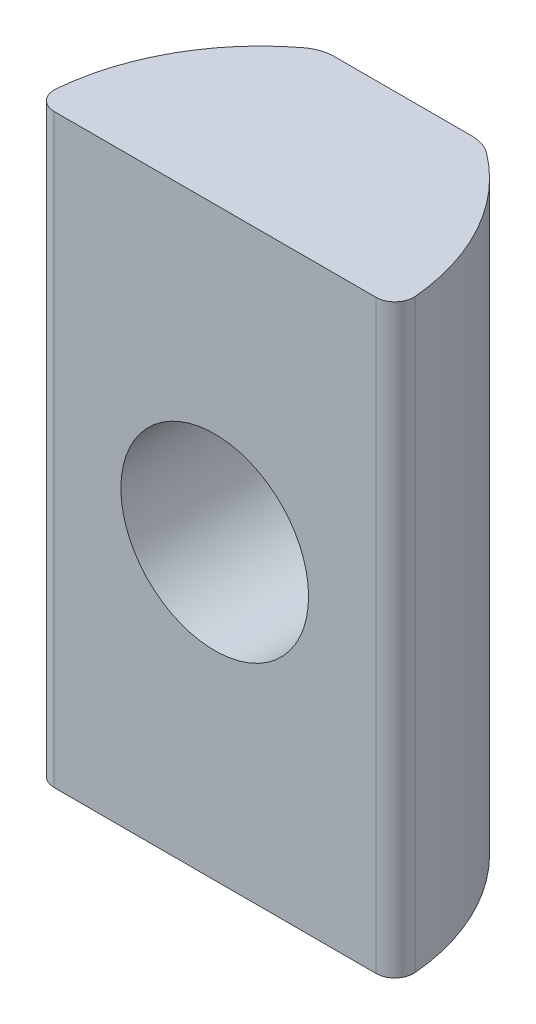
from build123d import *

# Parameters (mm, degrees)
EXTRUDE_1_DEPTH = 7.8
M6X1_0_1_D      = 5


with BuildPart() as part:
    # Sketch 1 → Extrude 1 (new, symmetric)
    with BuildSketch(Plane.XZ):
        with BuildLine():
            Line((-4.28842123, 0), (4.28842123, 0))
            ThreePointArc((4.28842123, 0), (4.657211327, -0.162370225), (4.786479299, -0.54402454))
            ThreePointArc((4.786479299, -0.54402454), (4.060490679, -2.919187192), (2.434814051, -4.796853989))
            ThreePointArc((2.434814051, -4.796853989), (2.149347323, -4.947853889), (1.830642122, -5))
            Line((1.830642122, -5), (-1.830642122, -5))
            ThreePointArc((-1.830642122, -5), (-2.149347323, -4.947853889), (-2.434814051, -4.796853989))
            ThreePointArc((-2.434814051, -4.796853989), (-4.060490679, -2.919187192), (-4.786479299, -0.54402454))
            ThreePointArc((-4.786479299, -0.54402454), (-4.657211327, -0.162370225), (-4.28842123, 0))
        make_face()
    extrude(amount=EXTRUDE_1_DEPTH, both=True)

    # M6x1.0 _1 (through all)
    with Locations(Plane(origin=(1.337388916, 5.214464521, 0), x_dir=(1, 0, 0), z_dir=(0, 0, 1))):
        with Locations((-1.348967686, -5.214464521)):
            Hole(M6X1_0_1_D / 2)


solid = part.part
